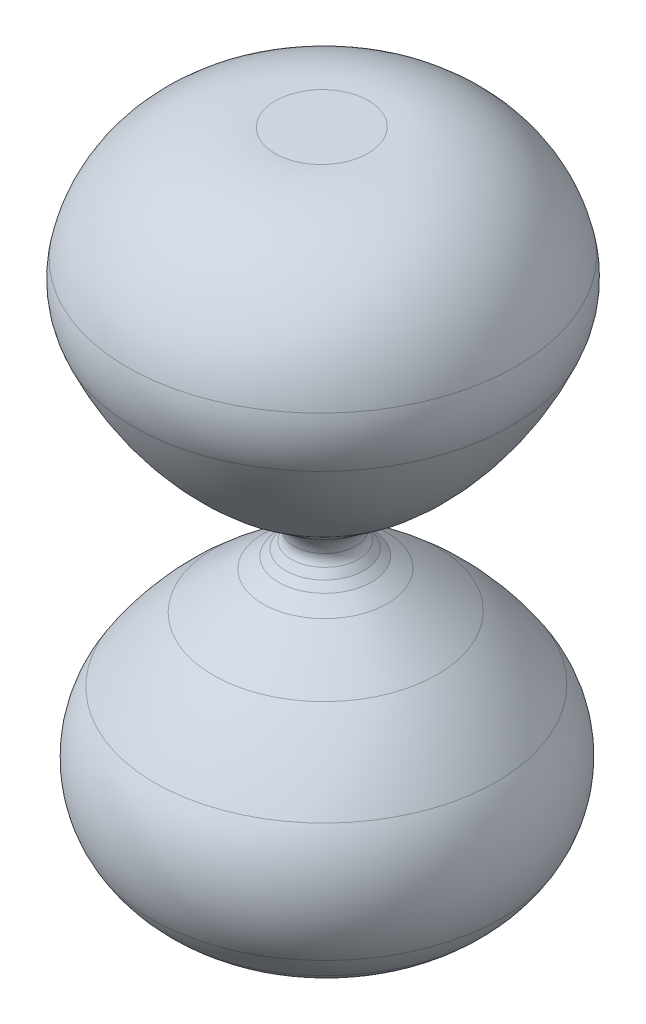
from build123d import *


with BuildPart() as part:
    # Sketch1 → Revolve7 (revolve)
    with BuildSketch(Plane.XY, mode=Mode.PRIVATE) as revolve7_sk:
        with BuildLine():
            Line((0.005277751, 121.322127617), (8.730429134, 121.322127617))
            ThreePointArc((8.730429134, 121.322127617), (26.583253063, 116.163052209), (36.661754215, 100.550134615))
            ThreePointArc((36.661754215, 100.550134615), (36.977867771, 95.383429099), (35.712952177, 90.363990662))
            ThreePointArc((35.712952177, 90.363990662), (28.756780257, 78.151476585), (19.160242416, 67.883064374))
            Line((19.160242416, 67.883064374), (8.730429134, 60.003118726))
            ThreePointArc((8.730429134, 60.003118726), (7.188053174, 58.278469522), (6.4132916, 56.098312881))
            ThreePointArc((6.4132916, 56.098312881), (6.474001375, 55.099847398), (6.933146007, 54.211137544))
            Line((6.933146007, 54.211137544), (8.009640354, 52.893311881))
            Line((8.009640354, 52.893311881), (9.373582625, 51.694207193))
            Line((9.373582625, 51.694207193), (12.345831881, 49.674668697))
            ThreePointArc((12.345831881, 49.674668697), (17.101910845, 46.31694011), (21.734605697, 42.790927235))
            ThreePointArc((21.734605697, 42.790927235), (27.757810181, 37.252845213), (32.88625169, 30.877232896))
            ThreePointArc((32.88625169, 30.877232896), (36.491433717, 20.136699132), (33.87154544, 9.114331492))
            ThreePointArc((33.87154544, 9.114331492), (31.975925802, 6.242578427), (29.690508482, 3.670185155))
            ThreePointArc((29.690508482, 3.670185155), (26.348382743, 0.893967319), (22.607701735, -1.316122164))
            ThreePointArc((22.607701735, -1.316122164), (21.469276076, -1.789036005), (20.282313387, -2.121872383))
            Line((20.282313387, -2.121872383), (1.165640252, -2.121872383))
            Line((1.165640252, -2.121872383), (0.005277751, 121.322127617))
        make_face()
    revolve(revolve7_sk.sketch.rotate(Axis((0.005277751, 121.322127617, 0), (0.009399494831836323, -0.9999558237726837, 0)), 180), axis=Axis((0.005277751, 121.322127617, 0), (0.009399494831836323, -0.9999558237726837, 0)))


solid = part.part
